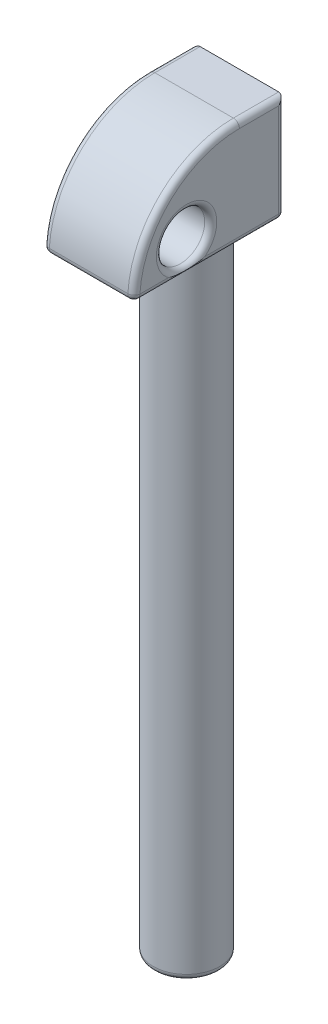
ISO-10303-21;
HEADER;
FILE_DESCRIPTION(('STEP AP214'),'2;1');
FILE_NAME('part.step','',(''),(''),'','','');
FILE_SCHEMA(('AUTOMOTIVE_DESIGN { 1 0 10303 214 1 1 1 1 }'));
ENDSEC;
DATA;
#1=APPLICATION_CONTEXT('core data for automotive mechanical design processes');
#2=APPLICATION_PROTOCOL_DEFINITION('international standard','automotive_design',2000,#1);
#3=PRODUCT_CONTEXT('',#1,'mechanical');
#4=PRODUCT('Part','Part','',(#3));
#5=PRODUCT_RELATED_PRODUCT_CATEGORY('part','',(#4));
#6=PRODUCT_DEFINITION_FORMATION('','',#4);
#7=PRODUCT_DEFINITION_CONTEXT('part definition',#1,'design');
#8=PRODUCT_DEFINITION('design','',#6,#7);
#9=PRODUCT_DEFINITION_SHAPE('','',#8);
#10=(LENGTH_UNIT() NAMED_UNIT(*) SI_UNIT(.MILLI.,.METRE.));
#11=(NAMED_UNIT(*) PLANE_ANGLE_UNIT() SI_UNIT($,.RADIAN.));
#12=(NAMED_UNIT(*) SI_UNIT($,.STERADIAN.) SOLID_ANGLE_UNIT());
#13=UNCERTAINTY_MEASURE_WITH_UNIT(LENGTH_MEASURE(1.E-05),#10,'distance_accuracy_value','');
#14=(GEOMETRIC_REPRESENTATION_CONTEXT(3) GLOBAL_UNCERTAINTY_ASSIGNED_CONTEXT((#13)) GLOBAL_UNIT_ASSIGNED_CONTEXT((#10,
#11,#12)) REPRESENTATION_CONTEXT('',''));
#15=CARTESIAN_POINT('',(0.,0.,0.));
#16=DIRECTION('',(0.,0.,1.));
#17=DIRECTION('',(1.,0.,0.));
#18=AXIS2_PLACEMENT_3D('',#15,#16,#17);
#19=CARTESIAN_POINT('',(3.,21.,6.5));
#20=DIRECTION('',(0.,1.,0.));
#21=DIRECTION('',(0.,0.,1.));
#22=AXIS2_PLACEMENT_3D('',#19,#20,#21);
#23=PLANE('',#22);
#24=CARTESIAN_POINT('',(0.,21.,0.));
#25=DIRECTION('',(0.,1.,0.));
#26=DIRECTION('',(0.,0.,1.));
#27=AXIS2_PLACEMENT_3D('',#24,#25,#26);
#28=CIRCLE('',#27,2.6);
#29=CARTESIAN_POINT('',(-2.6,21.,0.));
#30=VERTEX_POINT('',#29);
#31=CARTESIAN_POINT('',(0.,21.,2.6));
#32=VERTEX_POINT('',#31);
#33=EDGE_CURVE('E43',#30,#32,#28,.T.);
#34=ORIENTED_EDGE('',*,*,#33,.T.);
#35=CARTESIAN_POINT('',(0.,21.,0.));
#36=DIRECTION('',(0.,1.,0.));
#37=DIRECTION('',(0.,0.,1.));
#38=AXIS2_PLACEMENT_3D('',#35,#36,#37);
#39=CIRCLE('',#38,2.6);
#40=CARTESIAN_POINT('',(2.6,21.,0.));
#41=VERTEX_POINT('',#40);
#42=EDGE_CURVE('E204',#32,#41,#39,.T.);
#43=ORIENTED_EDGE('',*,*,#42,.T.);
#44=DIRECTION('',(0.,0.,-1.));
#45=VECTOR('',#44,1.);
#46=CARTESIAN_POINT('',(2.6,21.,6.5));
#47=LINE('',#46,#45);
#48=CARTESIAN_POINT('',(2.6,21.,6.08786763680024));
#49=VERTEX_POINT('',#48);
#50=EDGE_CURVE('E49',#41,#49,#47,.F.);
#51=ORIENTED_EDGE('',*,*,#50,.T.);
#52=DIRECTION('',(-1.,0.,0.));
#53=VECTOR('',#52,1.);
#54=CARTESIAN_POINT('',(3.,21.,6.08786763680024));
#55=LINE('',#54,#53);
#56=CARTESIAN_POINT('',(-2.6,21.,6.08786763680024));
#57=VERTEX_POINT('',#56);
#58=EDGE_CURVE('E198',#49,#57,#55,.T.);
#59=ORIENTED_EDGE('',*,*,#58,.T.);
#60=DIRECTION('',(0.,0.,-1.));
#61=VECTOR('',#60,1.);
#62=CARTESIAN_POINT('',(-2.6,21.,-3.5));
#63=LINE('',#62,#61);
#64=EDGE_CURVE('E191',#57,#30,#63,.T.);
#65=ORIENTED_EDGE('',*,*,#64,.T.);
#66=EDGE_LOOP('',(#34,#43,#51,#59,#65));
#67=FACE_BOUND('',#66,.T.);
#68=ADVANCED_FACE('F28',(#67),#23,.F.);
#69=CARTESIAN_POINT('',(0.,10.5831296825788,0.));
#70=DIRECTION('',(0.,1.,0.));
#71=DIRECTION('',(0.,0.,1.));
#72=AXIS2_PLACEMENT_3D('',#69,#70,#71);
#73=CYLINDRICAL_SURFACE('',#72,2.2);
#74=CARTESIAN_POINT('',(0.,20.6,0.));
#75=DIRECTION('',(0.,1.,0.));
#76=DIRECTION('',(0.,0.,1.));
#77=AXIS2_PLACEMENT_3D('',#74,#75,#76);
#78=CIRCLE('',#77,2.2);
#79=CARTESIAN_POINT('',(0.,20.6,2.2));
#80=VERTEX_POINT('',#79);
#81=EDGE_CURVE('E36',#80,#80,#78,.F.);
#82=ORIENTED_EDGE('',*,*,#81,.T.);
#83=EDGE_LOOP('',(#82));
#84=FACE_BOUND('',#83,.T.);
#85=CARTESIAN_POINT('',(0.,-20.6,0.));
#86=DIRECTION('',(0.,1.,0.));
#87=DIRECTION('',(0.,0.,1.));
#88=AXIS2_PLACEMENT_3D('',#85,#86,#87);
#89=CIRCLE('',#88,2.2);
#90=CARTESIAN_POINT('',(0.,-20.6,2.2));
#91=VERTEX_POINT('',#90);
#92=EDGE_CURVE('E206',#91,#91,#89,.T.);
#93=ORIENTED_EDGE('',*,*,#92,.T.);
#94=EDGE_LOOP('',(#93));
#95=FACE_BOUND('',#94,.T.);
#96=ADVANCED_FACE('F30',(#84,#95),#73,.T.);
#97=CARTESIAN_POINT('',(0.,-21.,0.));
#98=DIRECTION('',(0.,1.,0.));
#99=DIRECTION('',(0.,0.,1.));
#100=AXIS2_PLACEMENT_3D('',#97,#98,#99);
#101=PLANE('',#100);
#102=CARTESIAN_POINT('',(0.,-21.,0.));
#103=DIRECTION('',(0.,1.,0.));
#104=DIRECTION('',(0.,0.,1.));
#105=AXIS2_PLACEMENT_3D('',#102,#103,#104);
#106=CIRCLE('',#105,1.8);
#107=CARTESIAN_POINT('',(0.,-21.,1.8));
#108=VERTEX_POINT('',#107);
#109=EDGE_CURVE('E11',#108,#108,#106,.F.);
#110=ORIENTED_EDGE('',*,*,#109,.T.);
#111=EDGE_LOOP('',(#110));
#112=FACE_BOUND('',#111,.T.);
#113=ADVANCED_FACE('F319',(#112),#101,.F.);
#114=DIRECTION('',(0.,0.,-1.));
#115=VECTOR('',#114,1.);
#116=CARTESIAN_POINT('',(2.6,21.,6.5));
#117=LINE('',#116,#115);
#118=CARTESIAN_POINT('',(2.6,21.,-3.1));
#119=VERTEX_POINT('',#118);
#120=EDGE_CURVE('E195',#119,#41,#117,.F.);
#121=ORIENTED_EDGE('',*,*,#120,.T.);
#122=CARTESIAN_POINT('',(0.,21.,0.));
#123=DIRECTION('',(0.,1.,0.));
#124=DIRECTION('',(0.,0.,1.));
#125=AXIS2_PLACEMENT_3D('',#122,#123,#124);
#126=CIRCLE('',#125,2.6);
#127=EDGE_CURVE('E200',#41,#30,#126,.T.);
#128=ORIENTED_EDGE('',*,*,#127,.T.);
#129=DIRECTION('',(0.,0.,-1.));
#130=VECTOR('',#129,1.);
#131=CARTESIAN_POINT('',(-2.6,21.,-3.5));
#132=LINE('',#131,#130);
#133=CARTESIAN_POINT('',(-2.6,21.,-3.1));
#134=VERTEX_POINT('',#133);
#135=EDGE_CURVE('E189',#30,#134,#132,.T.);
#136=ORIENTED_EDGE('',*,*,#135,.T.);
#137=DIRECTION('',(-1.,0.,0.));
#138=VECTOR('',#137,1.);
#139=CARTESIAN_POINT('',(3.,21.,-3.1));
#140=LINE('',#139,#138);
#141=EDGE_CURVE('E193',#134,#119,#140,.F.);
#142=ORIENTED_EDGE('',*,*,#141,.T.);
#143=EDGE_LOOP('',(#121,#128,#136,#142));
#144=FACE_BOUND('',#143,.T.);
#145=ADVANCED_FACE('F220',(#144),#23,.F.);
#146=CARTESIAN_POINT('',(3.,21.,-0.499999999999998));
#147=DIRECTION('',(-1.,0.,0.));
#148=DIRECTION('',(0.,0.,1.));
#149=AXIS2_PLACEMENT_3D('',#146,#147,#148);
#150=PLANE('',#149);
#151=DIRECTION('',(0.,0.,1.));
#152=VECTOR('',#151,1.);
#153=CARTESIAN_POINT('',(3.,27.6,-0.499999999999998));
#154=LINE('',#153,#152);
#155=CARTESIAN_POINT('',(3.,27.6,-3.1));
#156=VERTEX_POINT('',#155);
#157=CARTESIAN_POINT('',(3.,27.6,-0.499999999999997));
#158=VERTEX_POINT('',#157);
#159=EDGE_CURVE('E151',#156,#158,#154,.T.);
#160=ORIENTED_EDGE('',*,*,#159,.T.);
#161=CARTESIAN_POINT('',(3.,21.,-0.499999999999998));
#162=DIRECTION('',(-1.,0.,0.));
#163=DIRECTION('',(0.,0.,1.));
#164=AXIS2_PLACEMENT_3D('',#161,#162,#163);
#165=CIRCLE('',#164,6.6);
#166=CARTESIAN_POINT('',(3.,21.4,6.08786763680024));
#167=VERTEX_POINT('',#166);
#168=EDGE_CURVE('E153',#158,#167,#165,.F.);
#169=ORIENTED_EDGE('',*,*,#168,.T.);
#170=DIRECTION('',(0.,0.,-1.));
#171=VECTOR('',#170,1.);
#172=CARTESIAN_POINT('',(3.,21.4,-0.499999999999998));
#173=LINE('',#172,#171);
#174=CARTESIAN_POINT('',(3.,21.4,4.2));
#175=VERTEX_POINT('',#174);
#176=EDGE_CURVE('E150',#167,#175,#173,.T.);
#177=ORIENTED_EDGE('',*,*,#176,.T.);
#178=CARTESIAN_POINT('',(3.,23.,3.));
#179=DIRECTION('',(-1.,0.,0.));
#180=DIRECTION('',(0.,0.,1.));
#181=AXIS2_PLACEMENT_3D('',#178,#179,#180);
#182=CIRCLE('',#181,2.);
#183=CARTESIAN_POINT('',(3.,21.4,1.8));
#184=VERTEX_POINT('',#183);
#185=EDGE_CURVE('E133',#175,#184,#182,.T.);
#186=ORIENTED_EDGE('',*,*,#185,.T.);
#187=DIRECTION('',(0.,0.,-1.));
#188=VECTOR('',#187,1.);
#189=CARTESIAN_POINT('',(3.,21.4,-0.499999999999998));
#190=LINE('',#189,#188);
#191=CARTESIAN_POINT('',(3.,21.4,-3.1));
#192=VERTEX_POINT('',#191);
#193=EDGE_CURVE('E139',#184,#192,#190,.T.);
#194=ORIENTED_EDGE('',*,*,#193,.T.);
#195=DIRECTION('',(0.,1.,0.));
#196=VECTOR('',#195,1.);
#197=CARTESIAN_POINT('',(3.,21.,-3.1));
#198=LINE('',#197,#196);
#199=EDGE_CURVE('E146',#192,#156,#198,.T.);
#200=ORIENTED_EDGE('',*,*,#199,.T.);
#201=EDGE_LOOP('',(#160,#169,#177,#186,#194,#200));
#202=FACE_BOUND('',#201,.T.);
#203=ADVANCED_FACE('F149',(#202),#150,.F.);
#204=CARTESIAN_POINT('',(-3.,21.,-0.499999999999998));
#205=DIRECTION('',(-1.,0.,0.));
#206=DIRECTION('',(0.,0.,1.));
#207=AXIS2_PLACEMENT_3D('',#204,#205,#206);
#208=PLANE('',#207);
#209=DIRECTION('',(0.,1.,0.));
#210=VECTOR('',#209,1.);
#211=CARTESIAN_POINT('',(-3.,21.,-3.1));
#212=LINE('',#211,#210);
#213=CARTESIAN_POINT('',(-3.,27.6,-3.1));
#214=VERTEX_POINT('',#213);
#215=CARTESIAN_POINT('',(-3.,21.4,-3.1));
#216=VERTEX_POINT('',#215);
#217=EDGE_CURVE('E182',#214,#216,#212,.F.);
#218=ORIENTED_EDGE('',*,*,#217,.T.);
#219=DIRECTION('',(0.,0.,-1.));
#220=VECTOR('',#219,1.);
#221=CARTESIAN_POINT('',(-3.,21.4,6.5));
#222=LINE('',#221,#220);
#223=CARTESIAN_POINT('',(-3.,21.4,1.8));
#224=VERTEX_POINT('',#223);
#225=EDGE_CURVE('E187',#216,#224,#222,.F.);
#226=ORIENTED_EDGE('',*,*,#225,.T.);
#227=CARTESIAN_POINT('',(-3.,23.,3.));
#228=DIRECTION('',(-1.,0.,0.));
#229=DIRECTION('',(0.,0.,1.));
#230=AXIS2_PLACEMENT_3D('',#227,#228,#229);
#231=CIRCLE('',#230,2.);
#232=CARTESIAN_POINT('',(-3.,21.4,4.2));
#233=VERTEX_POINT('',#232);
#234=EDGE_CURVE('E184',#224,#233,#231,.F.);
#235=ORIENTED_EDGE('',*,*,#234,.T.);
#236=DIRECTION('',(0.,0.,-1.));
#237=VECTOR('',#236,1.);
#238=CARTESIAN_POINT('',(-3.,21.4,6.5));
#239=LINE('',#238,#237);
#240=CARTESIAN_POINT('',(-3.,21.4,6.08786763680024));
#241=VERTEX_POINT('',#240);
#242=EDGE_CURVE('E176',#233,#241,#239,.F.);
#243=ORIENTED_EDGE('',*,*,#242,.T.);
#244=CARTESIAN_POINT('',(-3.,21.,-0.499999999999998));
#245=DIRECTION('',(-1.,0.,0.));
#246=DIRECTION('',(0.,0.,1.));
#247=AXIS2_PLACEMENT_3D('',#244,#245,#246);
#248=CIRCLE('',#247,6.6);
#249=CARTESIAN_POINT('',(-3.,27.6,-0.499999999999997));
#250=VERTEX_POINT('',#249);
#251=EDGE_CURVE('E178',#241,#250,#248,.T.);
#252=ORIENTED_EDGE('',*,*,#251,.T.);
#253=DIRECTION('',(0.,0.,1.));
#254=VECTOR('',#253,1.);
#255=CARTESIAN_POINT('',(-3.,27.6,-3.5));
#256=LINE('',#255,#254);
#257=EDGE_CURVE('E180',#250,#214,#256,.F.);
#258=ORIENTED_EDGE('',*,*,#257,.T.);
#259=EDGE_LOOP('',(#218,#226,#235,#243,#252,#258));
#260=FACE_BOUND('',#259,.T.);
#261=ADVANCED_FACE('F303',(#260),#208,.T.);
#262=CARTESIAN_POINT('',(3.,21.,-0.499999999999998));
#263=DIRECTION('',(-1.,0.,0.));
#264=DIRECTION('',(0.,0.,1.));
#265=AXIS2_PLACEMENT_3D('',#262,#263,#264);
#266=CYLINDRICAL_SURFACE('',#265,7.);
#267=DIRECTION('',(-1.,0.,0.));
#268=VECTOR('',#267,1.);
#269=CARTESIAN_POINT('',(3.,21.4242424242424,6.48713234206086));
#270=LINE('',#269,#268);
#271=CARTESIAN_POINT('',(-2.6,21.4242424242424,6.48713234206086));
#272=VERTEX_POINT('',#271);
#273=CARTESIAN_POINT('',(2.6,21.4242424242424,6.48713234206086));
#274=VERTEX_POINT('',#273);
#275=EDGE_CURVE('E170',#272,#274,#270,.F.);
#276=ORIENTED_EDGE('',*,*,#275,.T.);
#277=CARTESIAN_POINT('',(2.6,21.,-0.499999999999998));
#278=DIRECTION('',(-1.,0.,0.));
#279=DIRECTION('',(0.,0.,1.));
#280=AXIS2_PLACEMENT_3D('',#277,#278,#279);
#281=CIRCLE('',#280,7.);
#282=CARTESIAN_POINT('',(2.6,28.,-0.499999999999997));
#283=VERTEX_POINT('',#282);
#284=EDGE_CURVE('E174',#274,#283,#281,.T.);
#285=ORIENTED_EDGE('',*,*,#284,.T.);
#286=DIRECTION('',(-1.,0.,0.));
#287=VECTOR('',#286,1.);
#288=CARTESIAN_POINT('',(3.,28.,-0.499999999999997));
#289=LINE('',#288,#287);
#290=CARTESIAN_POINT('',(-2.6,28.,-0.499999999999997));
#291=VERTEX_POINT('',#290);
#292=EDGE_CURVE('E515',#283,#291,#289,.T.);
#293=ORIENTED_EDGE('',*,*,#292,.T.);
#294=CARTESIAN_POINT('',(-2.6,21.,-0.499999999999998));
#295=DIRECTION('',(-1.,0.,0.));
#296=DIRECTION('',(0.,0.,1.));
#297=AXIS2_PLACEMENT_3D('',#294,#295,#296);
#298=CIRCLE('',#297,7.);
#299=EDGE_CURVE('E172',#291,#272,#298,.F.);
#300=ORIENTED_EDGE('',*,*,#299,.T.);
#301=EDGE_LOOP('',(#276,#285,#293,#300));
#302=FACE_BOUND('',#301,.T.);
#303=ADVANCED_FACE('F306',(#302),#266,.T.);
#304=CARTESIAN_POINT('',(3.,21.,-3.5));
#305=DIRECTION('',(0.,0.,1.));
#306=DIRECTION('',(1.,0.,0.));
#307=AXIS2_PLACEMENT_3D('',#304,#305,#306);
#308=PLANE('',#307);
#309=DIRECTION('',(-1.,0.,0.));
#310=VECTOR('',#309,1.);
#311=CARTESIAN_POINT('',(3.,28.,-3.5));
#312=LINE('',#311,#310);
#313=CARTESIAN_POINT('',(2.6,28.,-3.5));
#314=VERTEX_POINT('',#313);
#315=CARTESIAN_POINT('',(-2.6,28.,-3.5));
#316=VERTEX_POINT('',#315);
#317=EDGE_CURVE('E513',#314,#316,#312,.T.);
#318=ORIENTED_EDGE('',*,*,#317,.F.);
#319=DIRECTION('',(0.,1.,0.));
#320=VECTOR('',#319,1.);
#321=CARTESIAN_POINT('',(2.6,21.,-3.5));
#322=LINE('',#321,#320);
#323=CARTESIAN_POINT('',(2.6,21.4,-3.5));
#324=VERTEX_POINT('',#323);
#325=EDGE_CURVE('E168',#314,#324,#322,.F.);
#326=ORIENTED_EDGE('',*,*,#325,.T.);
#327=DIRECTION('',(-1.,0.,0.));
#328=VECTOR('',#327,1.);
#329=CARTESIAN_POINT('',(3.,21.4,-3.5));
#330=LINE('',#329,#328);
#331=CARTESIAN_POINT('',(-2.6,21.4,-3.5));
#332=VERTEX_POINT('',#331);
#333=EDGE_CURVE('E164',#324,#332,#330,.T.);
#334=ORIENTED_EDGE('',*,*,#333,.T.);
#335=DIRECTION('',(0.,1.,0.));
#336=VECTOR('',#335,1.);
#337=CARTESIAN_POINT('',(-2.6,28.,-3.5));
#338=LINE('',#337,#336);
#339=EDGE_CURVE('E166',#332,#316,#338,.T.);
#340=ORIENTED_EDGE('',*,*,#339,.T.);
#341=EDGE_LOOP('',(#318,#326,#334,#340));
#342=FACE_BOUND('',#341,.T.);
#343=ADVANCED_FACE('F312',(#342),#308,.F.);
#344=CARTESIAN_POINT('',(3.,28.,-3.5));
#345=DIRECTION('',(0.,-1.,0.));
#346=DIRECTION('',(0.,0.,-1.));
#347=AXIS2_PLACEMENT_3D('',#344,#345,#346);
#348=PLANE('',#347);
#349=ORIENTED_EDGE('',*,*,#292,.F.);
#350=DIRECTION('',(0.,0.,1.));
#351=VECTOR('',#350,1.);
#352=CARTESIAN_POINT('',(2.6,28.,-3.5));
#353=LINE('',#352,#351);
#354=EDGE_CURVE('E161',#283,#314,#353,.F.);
#355=ORIENTED_EDGE('',*,*,#354,.T.);
#356=ORIENTED_EDGE('',*,*,#317,.T.);
#357=DIRECTION('',(0.,0.,1.));
#358=VECTOR('',#357,1.);
#359=CARTESIAN_POINT('',(-2.6,28.,-0.499999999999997));
#360=LINE('',#359,#358);
#361=EDGE_CURVE('E159',#316,#291,#360,.T.);
#362=ORIENTED_EDGE('',*,*,#361,.T.);
#363=EDGE_LOOP('',(#349,#355,#356,#362));
#364=FACE_BOUND('',#363,.T.);
#365=ADVANCED_FACE('F301',(#364),#348,.F.);
#366=CARTESIAN_POINT('',(3.,23.,3.));
#367=DIRECTION('',(-1.,0.,0.));
#368=DIRECTION('',(0.,0.,1.));
#369=AXIS2_PLACEMENT_3D('',#366,#367,#368);
#370=CYLINDRICAL_SURFACE('',#369,1.6);
#371=CARTESIAN_POINT('',(2.6,23.,3.));
#372=DIRECTION('',(-1.,0.,0.));
#373=DIRECTION('',(0.,0.,1.));
#374=AXIS2_PLACEMENT_3D('',#371,#372,#373);
#375=CIRCLE('',#374,1.6);
#376=CARTESIAN_POINT('',(2.6,23.,4.6));
#377=VERTEX_POINT('',#376);
#378=EDGE_CURVE('E147',#377,#377,#375,.F.);
#379=ORIENTED_EDGE('',*,*,#378,.T.);
#380=EDGE_LOOP('',(#379));
#381=FACE_BOUND('',#380,.T.);
#382=CARTESIAN_POINT('',(-2.6,23.,3.));
#383=DIRECTION('',(-1.,0.,0.));
#384=DIRECTION('',(0.,0.,1.));
#385=AXIS2_PLACEMENT_3D('',#382,#383,#384);
#386=CIRCLE('',#385,1.6);
#387=CARTESIAN_POINT('',(-2.6,23.,4.6));
#388=VERTEX_POINT('',#387);
#389=EDGE_CURVE('E510',#388,#388,#386,.T.);
#390=ORIENTED_EDGE('',*,*,#389,.T.);
#391=EDGE_LOOP('',(#390));
#392=FACE_BOUND('',#391,.T.);
#393=ADVANCED_FACE('F290',(#381,#392),#370,.F.);
#394=CARTESIAN_POINT('',(-2.6,23.,3.));
#395=DIRECTION('',(-1.,0.,0.));
#396=DIRECTION('',(0.,0.,1.));
#397=AXIS2_PLACEMENT_3D('',#394,#395,#396);
#398=TOROIDAL_SURFACE('',#397,2.,0.4);
#399=ORIENTED_EDGE('',*,*,#389,.F.);
#400=EDGE_LOOP('',(#399));
#401=FACE_BOUND('',#400,.T.);
#402=CARTESIAN_POINT('',(-3.,21.4,4.2));
#403=CARTESIAN_POINT('',(-2.99999998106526,21.3994556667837,4.19836701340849));
#404=CARTESIAN_POINT('',(-2.99999887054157,21.3989123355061,4.19673368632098));
#405=CARTESIAN_POINT('',(-2.99982569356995,21.3560589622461,4.06764550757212));
#406=CARTESIAN_POINT('',(-2.99307431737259,21.3198559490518,3.93812724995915));
#407=CARTESIAN_POINT('',(-2.97635756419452,21.2611130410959,3.67616935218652));
#408=CARTESIAN_POINT('',(-2.96638824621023,21.2385899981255,3.54372631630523));
#409=CARTESIAN_POINT('',(-2.9550744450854,21.2156259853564,3.34226107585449));
#410=CARTESIAN_POINT('',(-2.95189730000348,21.2097725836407,3.27395492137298));
#411=CARTESIAN_POINT('',(-2.94756625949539,21.2019611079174,3.13709880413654));
#412=CARTESIAN_POINT('',(-2.94641084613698,21.2000001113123,3.06854906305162));
#413=CARTESIAN_POINT('',(-2.94640948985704,21.1999998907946,2.93274912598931));
#414=CARTESIAN_POINT('',(-2.94752022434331,21.2018870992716,2.86549890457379));
#415=CARTESIAN_POINT('',(-2.9516980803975,21.2094050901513,2.73125485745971));
#416=CARTESIAN_POINT('',(-2.95476576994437,21.2150369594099,2.66426111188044));
#417=CARTESIAN_POINT('',(-2.96215832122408,21.2299702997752,2.53068948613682));
#418=CARTESIAN_POINT('',(-2.96648449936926,21.2392756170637,2.46411211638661));
#419=CARTESIAN_POINT('',(-2.97542649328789,21.2614451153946,2.33157124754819));
#420=CARTESIAN_POINT('',(-2.9800423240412,21.2743094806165,2.26560778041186));
#421=CARTESIAN_POINT('',(-2.98854398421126,21.3037104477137,2.13330253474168));
#422=CARTESIAN_POINT('',(-2.9924164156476,21.3203044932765,2.06697266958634));
#423=CARTESIAN_POINT('',(-2.99809781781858,21.3568653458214,1.93521708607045));
#424=CARTESIAN_POINT('',(-2.99990916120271,21.3768282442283,1.86979041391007));
#425=CARTESIAN_POINT('',(-2.9999988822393,21.3989123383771,1.80326631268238));
#426=CARTESIAN_POINT('',(-2.9999999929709,21.3994556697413,1.80163298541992));
#427=CARTESIAN_POINT('',(-3.,21.4,1.8));
#428=B_SPLINE_CURVE_WITH_KNOTS('',3,(#402,#403,#404,#405,#406,#407,#408,#409,#410,#411,#412,
#413,#414,#415,#416,#417,#418,#419,#420,#421,#422,#423,#424,#425,#426,#427),.UNSPECIFIED.,.F.,
.F.,(4,2,2,2,2,2,2,2,2,2,2,2,4),(0.,0.00516397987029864,0.408044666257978,0.811420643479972,
1.01718686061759,1.22279852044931,1.42451628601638,1.62629262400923,1.82828078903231,
2.0302794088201,2.23563303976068,2.440750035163,2.4459140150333),.UNSPECIFIED.);
#429=EDGE_CURVE('E272',#233,#224,#428,.T.);
#430=ORIENTED_EDGE('',*,*,#429,.F.);
#431=ORIENTED_EDGE('',*,*,#234,.F.);
#432=EDGE_LOOP('',(#430,#431));
#433=FACE_BOUND('',#432,.T.);
#434=ADVANCED_FACE('F285',(#401,#433),#398,.T.);
#435=CARTESIAN_POINT('',(-2.6,27.6,-3.5));
#436=DIRECTION('',(0.,0.,-1.));
#437=DIRECTION('',(-1.,0.,0.));
#438=AXIS2_PLACEMENT_3D('',#435,#436,#437);
#439=CYLINDRICAL_SURFACE('',#438,0.4);
#440=CARTESIAN_POINT('',(-2.6,27.6,-0.499999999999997));
#441=DIRECTION('',(0.,0.,1.));
#442=DIRECTION('',(1.,0.,0.));
#443=AXIS2_PLACEMENT_3D('',#440,#441,#442);
#444=CIRCLE('',#443,0.4);
#445=EDGE_CURVE('E269',#291,#250,#444,.T.);
#446=ORIENTED_EDGE('',*,*,#445,.F.);
#447=ORIENTED_EDGE('',*,*,#361,.F.);
#448=CARTESIAN_POINT('',(-2.6,27.6,-3.1));
#449=DIRECTION('',(0.,-0.707106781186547,-0.707106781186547));
#450=DIRECTION('',(0.,0.707106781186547,-0.707106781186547));
#451=AXIS2_PLACEMENT_3D('',#448,#449,#450);
#452=ELLIPSE('',#451,0.565685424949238,0.4);
#453=EDGE_CURVE('E280',#214,#316,#452,.T.);
#454=ORIENTED_EDGE('',*,*,#453,.F.);
#455=ORIENTED_EDGE('',*,*,#257,.F.);
#456=EDGE_LOOP('',(#446,#447,#454,#455));
#457=FACE_BOUND('',#456,.T.);
#458=ADVANCED_FACE('F289',(#457),#439,.T.);
#459=CARTESIAN_POINT('',(-2.6,21.,-3.1));
#460=DIRECTION('',(0.,-1.,0.));
#461=DIRECTION('',(0.,0.,-1.));
#462=AXIS2_PLACEMENT_3D('',#459,#460,#461);
#463=CYLINDRICAL_SURFACE('',#462,0.4);
#464=ORIENTED_EDGE('',*,*,#453,.T.);
#465=ORIENTED_EDGE('',*,*,#339,.F.);
#466=CARTESIAN_POINT('',(-2.6,21.4,-3.1));
#467=DIRECTION('',(0.,-1.,0.));
#468=DIRECTION('',(0.,0.,-1.));
#469=AXIS2_PLACEMENT_3D('',#466,#467,#468);
#470=CIRCLE('',#469,0.4);
#471=EDGE_CURVE('E266',#216,#332,#470,.T.);
#472=ORIENTED_EDGE('',*,*,#471,.F.);
#473=ORIENTED_EDGE('',*,*,#217,.F.);
#474=EDGE_LOOP('',(#464,#465,#472,#473));
#475=FACE_BOUND('',#474,.T.);
#476=ADVANCED_FACE('F292',(#475),#463,.T.);
#477=CARTESIAN_POINT('',(-2.6,21.4,6.5));
#478=DIRECTION('',(0.,0.,1.));
#479=DIRECTION('',(1.,0.,0.));
#480=AXIS2_PLACEMENT_3D('',#477,#478,#479);
#481=CYLINDRICAL_SURFACE('',#480,0.4);
#482=ORIENTED_EDGE('',*,*,#429,.T.);
#483=ORIENTED_EDGE('',*,*,#225,.F.);
#484=CARTESIAN_POINT('',(-2.6,21.4,-3.1));
#485=DIRECTION('',(0.,0.,-1.));
#486=DIRECTION('',(-1.,0.,0.));
#487=AXIS2_PLACEMENT_3D('',#484,#485,#486);
#488=CIRCLE('',#487,0.4);
#489=EDGE_CURVE('E263',#134,#216,#488,.T.);
#490=ORIENTED_EDGE('',*,*,#489,.F.);
#491=ORIENTED_EDGE('',*,*,#135,.F.);
#492=ORIENTED_EDGE('',*,*,#64,.F.);
#493=CARTESIAN_POINT('',(-2.6,21.4,6.08786763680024));
#494=DIRECTION('',(0.,0.,1.));
#495=DIRECTION('',(1.,0.,0.));
#496=AXIS2_PLACEMENT_3D('',#493,#494,#495);
#497=CIRCLE('',#496,0.4);
#498=EDGE_CURVE('E260',#241,#57,#497,.T.);
#499=ORIENTED_EDGE('',*,*,#498,.F.);
#500=ORIENTED_EDGE('',*,*,#242,.F.);
#501=EDGE_LOOP('',(#482,#483,#490,#491,#492,#499,#500));
#502=FACE_BOUND('',#501,.T.);
#503=ADVANCED_FACE('F282',(#502),#481,.T.);
#504=CARTESIAN_POINT('',(-2.6,21.,-0.499999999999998));
#505=DIRECTION('',(-1.,0.,0.));
#506=DIRECTION('',(0.,0.,1.));
#507=AXIS2_PLACEMENT_3D('',#504,#505,#506);
#508=TOROIDAL_SURFACE('',#507,6.6,0.4);
#509=ORIENTED_EDGE('',*,*,#445,.T.);
#510=ORIENTED_EDGE('',*,*,#251,.F.);
#511=CARTESIAN_POINT('',(-2.6,21.4,6.08786763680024));
#512=DIRECTION('',(0.,-0.998161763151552,0.0606060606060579));
#513=DIRECTION('',(0.,-0.0606060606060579,-0.998161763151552));
#514=AXIS2_PLACEMENT_3D('',#511,#512,#513);
#515=CIRCLE('',#514,0.4);
#516=EDGE_CURVE('E257',#272,#241,#515,.T.);
#517=ORIENTED_EDGE('',*,*,#516,.F.);
#518=ORIENTED_EDGE('',*,*,#299,.F.);
#519=EDGE_LOOP('',(#509,#510,#517,#518));
#520=FACE_BOUND('',#519,.T.);
#521=ADVANCED_FACE('F382',(#520),#508,.T.);
#522=CARTESIAN_POINT('',(-2.6,21.4,-3.1));
#523=DIRECTION('',(0.,0.,1.));
#524=DIRECTION('',(1.,0.,0.));
#525=AXIS2_PLACEMENT_3D('',#522,#523,#524);
#526=SPHERICAL_SURFACE('',#525,0.4);
#527=ORIENTED_EDGE('',*,*,#489,.T.);
#528=ORIENTED_EDGE('',*,*,#471,.T.);
#529=CARTESIAN_POINT('',(-2.6,21.4,-3.1));
#530=DIRECTION('',(-1.,0.,0.));
#531=DIRECTION('',(0.,0.,1.));
#532=AXIS2_PLACEMENT_3D('',#529,#530,#531);
#533=CIRCLE('',#532,0.4);
#534=EDGE_CURVE('E251',#134,#332,#533,.F.);
#535=ORIENTED_EDGE('',*,*,#534,.F.);
#536=EDGE_LOOP('',(#527,#528,#535));
#537=FACE_BOUND('',#536,.T.);
#538=ADVANCED_FACE('F389',(#537),#526,.T.);
#539=CARTESIAN_POINT('',(-2.6,21.4,6.08786763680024));
#540=DIRECTION('',(0.,0.,1.));
#541=DIRECTION('',(1.,0.,0.));
#542=AXIS2_PLACEMENT_3D('',#539,#540,#541);
#543=SPHERICAL_SURFACE('',#542,0.4);
#544=ORIENTED_EDGE('',*,*,#516,.T.);
#545=ORIENTED_EDGE('',*,*,#498,.T.);
#546=CARTESIAN_POINT('',(-2.6,21.4,6.08786763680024));
#547=DIRECTION('',(-1.,0.,0.));
#548=DIRECTION('',(0.,0.,1.));
#549=AXIS2_PLACEMENT_3D('',#546,#547,#548);
#550=CIRCLE('',#549,0.4);
#551=EDGE_CURVE('E249',#272,#57,#550,.F.);
#552=ORIENTED_EDGE('',*,*,#551,.F.);
#553=EDGE_LOOP('',(#544,#545,#552));
#554=FACE_BOUND('',#553,.T.);
#555=ADVANCED_FACE('F396',(#554),#543,.T.);
#556=CARTESIAN_POINT('',(2.6,27.6,-0.499999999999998));
#557=DIRECTION('',(0.,0.,1.));
#558=DIRECTION('',(1.,0.,0.));
#559=AXIS2_PLACEMENT_3D('',#556,#557,#558);
#560=CYLINDRICAL_SURFACE('',#559,0.4);
#561=CARTESIAN_POINT('',(2.6,27.6,-0.499999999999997));
#562=DIRECTION('',(0.,0.,1.));
#563=DIRECTION('',(1.,0.,0.));
#564=AXIS2_PLACEMENT_3D('',#561,#562,#563);
#565=CIRCLE('',#564,0.4);
#566=EDGE_CURVE('E246',#158,#283,#565,.T.);
#567=ORIENTED_EDGE('',*,*,#566,.F.);
#568=ORIENTED_EDGE('',*,*,#159,.F.);
#569=CARTESIAN_POINT('',(2.6,27.6,-3.1));
#570=DIRECTION('',(0.,0.707106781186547,0.707106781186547));
#571=DIRECTION('',(0.,0.707106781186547,-0.707106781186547));
#572=AXIS2_PLACEMENT_3D('',#569,#570,#571);
#573=ELLIPSE('',#572,0.565685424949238,0.4);
#574=EDGE_CURVE('E254',#314,#156,#573,.F.);
#575=ORIENTED_EDGE('',*,*,#574,.F.);
#576=ORIENTED_EDGE('',*,*,#354,.F.);
#577=EDGE_LOOP('',(#567,#568,#575,#576));
#578=FACE_BOUND('',#577,.T.);
#579=ADVANCED_FACE('F404',(#578),#560,.T.);
#580=CARTESIAN_POINT('',(2.6,21.,-3.1));
#581=DIRECTION('',(0.,1.,0.));
#582=DIRECTION('',(0.,0.,1.));
#583=AXIS2_PLACEMENT_3D('',#580,#581,#582);
#584=CYLINDRICAL_SURFACE('',#583,0.4);
#585=ORIENTED_EDGE('',*,*,#574,.T.);
#586=ORIENTED_EDGE('',*,*,#199,.F.);
#587=CARTESIAN_POINT('',(2.6,21.4,-3.1));
#588=DIRECTION('',(0.,-1.,0.));
#589=DIRECTION('',(0.,0.,-1.));
#590=AXIS2_PLACEMENT_3D('',#587,#588,#589);
#591=CIRCLE('',#590,0.4);
#592=EDGE_CURVE('E243',#324,#192,#591,.T.);
#593=ORIENTED_EDGE('',*,*,#592,.F.);
#594=ORIENTED_EDGE('',*,*,#325,.F.);
#595=EDGE_LOOP('',(#585,#586,#593,#594));
#596=FACE_BOUND('',#595,.T.);
#597=ADVANCED_FACE('F412',(#596),#584,.T.);
#598=CARTESIAN_POINT('',(3.,21.4,-3.1));
#599=DIRECTION('',(-1.,0.,0.));
#600=DIRECTION('',(0.,0.,1.));
#601=AXIS2_PLACEMENT_3D('',#598,#599,#600);
#602=CYLINDRICAL_SURFACE('',#601,0.4);
#603=ORIENTED_EDGE('',*,*,#534,.T.);
#604=ORIENTED_EDGE('',*,*,#333,.F.);
#605=CARTESIAN_POINT('',(2.6,21.4,-3.1));
#606=DIRECTION('',(1.,0.,0.));
#607=DIRECTION('',(0.,0.,-1.));
#608=AXIS2_PLACEMENT_3D('',#605,#606,#607);
#609=CIRCLE('',#608,0.4);
#610=EDGE_CURVE('E240',#119,#324,#609,.T.);
#611=ORIENTED_EDGE('',*,*,#610,.F.);
#612=ORIENTED_EDGE('',*,*,#141,.F.);
#613=EDGE_LOOP('',(#603,#604,#611,#612));
#614=FACE_BOUND('',#613,.T.);
#615=ADVANCED_FACE('F420',(#614),#602,.T.);
#616=CARTESIAN_POINT('',(3.,21.4,6.08786763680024));
#617=DIRECTION('',(-1.,0.,0.));
#618=DIRECTION('',(0.,0.,1.));
#619=AXIS2_PLACEMENT_3D('',#616,#617,#618);
#620=CYLINDRICAL_SURFACE('',#619,0.4);
#621=ORIENTED_EDGE('',*,*,#551,.T.);
#622=ORIENTED_EDGE('',*,*,#58,.F.);
#623=CARTESIAN_POINT('',(2.6,21.4,6.08786763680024));
#624=DIRECTION('',(1.,0.,0.));
#625=DIRECTION('',(0.,0.,-1.));
#626=AXIS2_PLACEMENT_3D('',#623,#624,#625);
#627=CIRCLE('',#626,0.4);
#628=EDGE_CURVE('E238',#274,#49,#627,.T.);
#629=ORIENTED_EDGE('',*,*,#628,.F.);
#630=ORIENTED_EDGE('',*,*,#275,.F.);
#631=EDGE_LOOP('',(#621,#622,#629,#630));
#632=FACE_BOUND('',#631,.T.);
#633=ADVANCED_FACE('F428',(#632),#620,.T.);
#634=CARTESIAN_POINT('',(2.6,21.,-0.499999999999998));
#635=DIRECTION('',(-1.,0.,0.));
#636=DIRECTION('',(0.,0.,1.));
#637=AXIS2_PLACEMENT_3D('',#634,#635,#636);
#638=TOROIDAL_SURFACE('',#637,6.6,0.4);
#639=ORIENTED_EDGE('',*,*,#566,.T.);
#640=ORIENTED_EDGE('',*,*,#284,.F.);
#641=CARTESIAN_POINT('',(2.6,21.4,6.08786763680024));
#642=DIRECTION('',(0.,-0.998161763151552,0.0606060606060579));
#643=DIRECTION('',(0.,-0.0606060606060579,-0.998161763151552));
#644=AXIS2_PLACEMENT_3D('',#641,#642,#643);
#645=CIRCLE('',#644,0.4);
#646=EDGE_CURVE('E229',#167,#274,#645,.T.);
#647=ORIENTED_EDGE('',*,*,#646,.F.);
#648=ORIENTED_EDGE('',*,*,#168,.F.);
#649=EDGE_LOOP('',(#639,#640,#647,#648));
#650=FACE_BOUND('',#649,.T.);
#651=ADVANCED_FACE('F436',(#650),#638,.T.);
#652=CARTESIAN_POINT('',(2.6,21.4,-3.1));
#653=DIRECTION('',(0.,0.,1.));
#654=DIRECTION('',(1.,0.,0.));
#655=AXIS2_PLACEMENT_3D('',#652,#653,#654);
#656=SPHERICAL_SURFACE('',#655,0.4);
#657=ORIENTED_EDGE('',*,*,#610,.T.);
#658=ORIENTED_EDGE('',*,*,#592,.T.);
#659=CARTESIAN_POINT('',(2.6,21.4,-3.1));
#660=DIRECTION('',(0.,0.,-1.));
#661=DIRECTION('',(-1.,0.,0.));
#662=AXIS2_PLACEMENT_3D('',#659,#660,#661);
#663=CIRCLE('',#662,0.4);
#664=EDGE_CURVE('E143',#119,#192,#663,.F.);
#665=ORIENTED_EDGE('',*,*,#664,.F.);
#666=EDGE_LOOP('',(#657,#658,#665));
#667=FACE_BOUND('',#666,.T.);
#668=ADVANCED_FACE('F444',(#667),#656,.T.);
#669=CARTESIAN_POINT('',(2.6,21.4,6.08786763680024));
#670=DIRECTION('',(0.,0.,1.));
#671=DIRECTION('',(1.,0.,0.));
#672=AXIS2_PLACEMENT_3D('',#669,#670,#671);
#673=SPHERICAL_SURFACE('',#672,0.4);
#674=ORIENTED_EDGE('',*,*,#646,.T.);
#675=ORIENTED_EDGE('',*,*,#628,.T.);
#676=CARTESIAN_POINT('',(2.6,21.4,6.08786763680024));
#677=DIRECTION('',(0.,0.,1.));
#678=DIRECTION('',(1.,0.,0.));
#679=AXIS2_PLACEMENT_3D('',#676,#677,#678);
#680=CIRCLE('',#679,0.4);
#681=EDGE_CURVE('E136',#167,#49,#680,.F.);
#682=ORIENTED_EDGE('',*,*,#681,.F.);
#683=EDGE_LOOP('',(#674,#675,#682));
#684=FACE_BOUND('',#683,.T.);
#685=ADVANCED_FACE('F452',(#684),#673,.T.);
#686=CARTESIAN_POINT('',(2.6,21.4,-0.499999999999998));
#687=DIRECTION('',(0.,0.,-1.));
#688=DIRECTION('',(-1.,0.,0.));
#689=AXIS2_PLACEMENT_3D('',#686,#687,#688);
#690=CYLINDRICAL_SURFACE('',#689,0.4);
#691=ORIENTED_EDGE('',*,*,#664,.T.);
#692=ORIENTED_EDGE('',*,*,#193,.F.);
#693=CARTESIAN_POINT('',(3.,21.4,4.2));
#694=CARTESIAN_POINT('',(2.99999998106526,21.3994556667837,4.19836701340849));
#695=CARTESIAN_POINT('',(2.99999887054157,21.3989123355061,4.19673368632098));
#696=CARTESIAN_POINT('',(2.99982569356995,21.3560589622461,4.06764550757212));
#697=CARTESIAN_POINT('',(2.99307431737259,21.3198559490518,3.93812724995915));
#698=CARTESIAN_POINT('',(2.97635756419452,21.2611130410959,3.67616935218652));
#699=CARTESIAN_POINT('',(2.96638824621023,21.2385899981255,3.54372631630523));
#700=CARTESIAN_POINT('',(2.9550744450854,21.2156259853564,3.34226107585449));
#701=CARTESIAN_POINT('',(2.95189730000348,21.2097725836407,3.27395492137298));
#702=CARTESIAN_POINT('',(2.94756625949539,21.2019611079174,3.13709880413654));
#703=CARTESIAN_POINT('',(2.94641084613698,21.2000001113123,3.06854906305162));
#704=CARTESIAN_POINT('',(2.94640948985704,21.1999998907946,2.93274912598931));
#705=CARTESIAN_POINT('',(2.94752022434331,21.2018870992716,2.86549890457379));
#706=CARTESIAN_POINT('',(2.9516980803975,21.2094050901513,2.73125485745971));
#707=CARTESIAN_POINT('',(2.95476576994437,21.2150369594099,2.66426111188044));
#708=CARTESIAN_POINT('',(2.96215832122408,21.2299702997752,2.53068948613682));
#709=CARTESIAN_POINT('',(2.96648449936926,21.2392756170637,2.46411211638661));
#710=CARTESIAN_POINT('',(2.97542649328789,21.2614451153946,2.33157124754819));
#711=CARTESIAN_POINT('',(2.9800423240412,21.2743094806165,2.26560778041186));
#712=CARTESIAN_POINT('',(2.98854398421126,21.3037104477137,2.13330253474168));
#713=CARTESIAN_POINT('',(2.9924164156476,21.3203044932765,2.06697266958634));
#714=CARTESIAN_POINT('',(2.99809781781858,21.3568653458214,1.93521708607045));
#715=CARTESIAN_POINT('',(2.99990916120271,21.3768282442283,1.86979041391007));
#716=CARTESIAN_POINT('',(2.9999988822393,21.3989123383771,1.80326631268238));
#717=CARTESIAN_POINT('',(2.9999999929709,21.3994556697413,1.80163298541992));
#718=CARTESIAN_POINT('',(3.,21.4,1.8));
#719=B_SPLINE_CURVE_WITH_KNOTS('',3,(#693,#694,#695,#696,#697,#698,#699,#700,#701,#702,#703,
#704,#705,#706,#707,#708,#709,#710,#711,#712,#713,#714,#715,#716,#717,#718),.UNSPECIFIED.,.F.,
.F.,(4,2,2,2,2,2,2,2,2,2,2,2,4),(0.,0.00516397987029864,0.408044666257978,0.811420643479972,
1.01718686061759,1.22279852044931,1.42451628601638,1.62629262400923,1.82828078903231,
2.0302794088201,2.23563303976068,2.440750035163,2.4459140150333),.UNSPECIFIED.);
#720=EDGE_CURVE('E128',#175,#184,#719,.T.);
#721=ORIENTED_EDGE('',*,*,#720,.F.);
#722=ORIENTED_EDGE('',*,*,#176,.F.);
#723=ORIENTED_EDGE('',*,*,#681,.T.);
#724=ORIENTED_EDGE('',*,*,#50,.F.);
#725=ORIENTED_EDGE('',*,*,#120,.F.);
#726=EDGE_LOOP('',(#691,#692,#721,#722,#723,#724,#725));
#727=FACE_BOUND('',#726,.T.);
#728=ADVANCED_FACE('F140',(#727),#690,.T.);
#729=CARTESIAN_POINT('',(2.6,23.,3.));
#730=DIRECTION('',(-1.,0.,0.));
#731=DIRECTION('',(0.,0.,1.));
#732=AXIS2_PLACEMENT_3D('',#729,#730,#731);
#733=TOROIDAL_SURFACE('',#732,2.,0.4);
#734=ORIENTED_EDGE('',*,*,#720,.T.);
#735=ORIENTED_EDGE('',*,*,#185,.F.);
#736=EDGE_LOOP('',(#734,#735));
#737=FACE_BOUND('',#736,.T.);
#738=ORIENTED_EDGE('',*,*,#378,.F.);
#739=EDGE_LOOP('',(#738));
#740=FACE_BOUND('',#739,.T.);
#741=ADVANCED_FACE('F130',(#737,#740),#733,.T.);
#742=CARTESIAN_POINT('',(0.,20.6,0.));
#743=DIRECTION('',(0.,1.,0.));
#744=DIRECTION('',(0.,0.,1.));
#745=AXIS2_PLACEMENT_3D('',#742,#743,#744);
#746=TOROIDAL_SURFACE('',#745,2.6,0.4);
#747=ORIENTED_EDGE('',*,*,#81,.F.);
#748=EDGE_LOOP('',(#747));
#749=FACE_BOUND('',#748,.T.);
#750=ORIENTED_EDGE('',*,*,#127,.F.);
#751=ORIENTED_EDGE('',*,*,#42,.F.);
#752=ORIENTED_EDGE('',*,*,#33,.F.);
#753=EDGE_LOOP('',(#750,#751,#752));
#754=FACE_BOUND('',#753,.T.);
#755=ADVANCED_FACE('F213',(#749,#754),#746,.F.);
#756=CARTESIAN_POINT('',(0.,-20.6,0.));
#757=DIRECTION('',(0.,1.,0.));
#758=DIRECTION('',(0.,0.,1.));
#759=AXIS2_PLACEMENT_3D('',#756,#757,#758);
#760=TOROIDAL_SURFACE('',#759,1.8,0.4);
#761=ORIENTED_EDGE('',*,*,#109,.F.);
#762=EDGE_LOOP('',(#761));
#763=FACE_BOUND('',#762,.T.);
#764=ORIENTED_EDGE('',*,*,#92,.F.);
#765=EDGE_LOOP('',(#764));
#766=FACE_BOUND('',#765,.T.);
#767=ADVANCED_FACE('F216',(#763,#766),#760,.T.);
#768=CLOSED_SHELL('',(#68,#96,#113,#145,#203,#261,#303,#343,#365,#393,#434,#458,#476,#503,#521,
#538,#555,#579,#597,#615,#633,#651,#668,#685,#728,#741,#755,#767));
#769=MANIFOLD_SOLID_BREP('B2',#768);
#770=ADVANCED_BREP_SHAPE_REPRESENTATION('',(#18,#769),#14);
#771=SHAPE_DEFINITION_REPRESENTATION(#9,#770);
ENDSEC;
END-ISO-10303-21;
